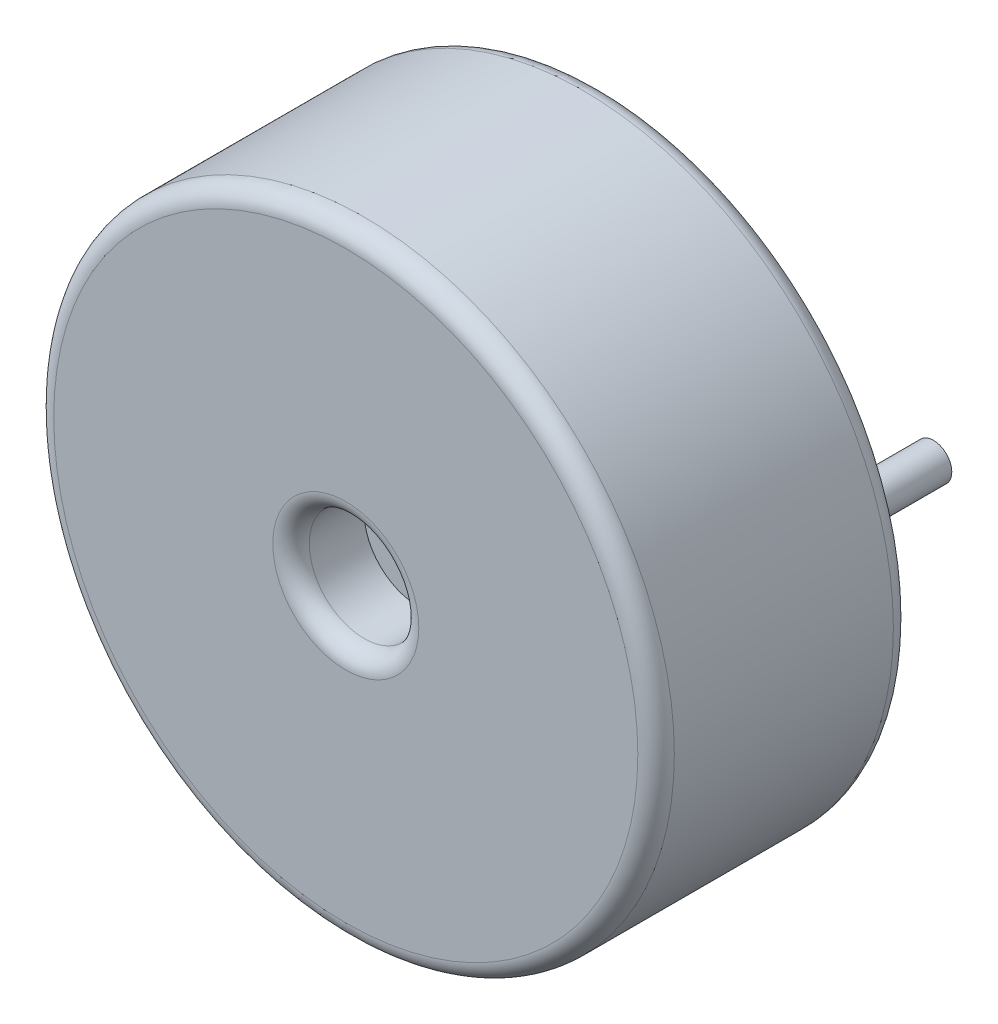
ISO-10303-21;
HEADER;
FILE_DESCRIPTION(('STEP AP214'),'2;1');
FILE_NAME('part.step','',(''),(''),'','','');
FILE_SCHEMA(('AUTOMOTIVE_DESIGN { 1 0 10303 214 1 1 1 1 }'));
ENDSEC;
DATA;
#1=APPLICATION_CONTEXT('core data for automotive mechanical design processes');
#2=APPLICATION_PROTOCOL_DEFINITION('international standard','automotive_design',2000,#1);
#3=PRODUCT_CONTEXT('',#1,'mechanical');
#4=PRODUCT('Part','Part','',(#3));
#5=PRODUCT_RELATED_PRODUCT_CATEGORY('part','',(#4));
#6=PRODUCT_DEFINITION_FORMATION('','',#4);
#7=PRODUCT_DEFINITION_CONTEXT('part definition',#1,'design');
#8=PRODUCT_DEFINITION('design','',#6,#7);
#9=PRODUCT_DEFINITION_SHAPE('','',#8);
#10=(LENGTH_UNIT() NAMED_UNIT(*) SI_UNIT(.MILLI.,.METRE.));
#11=(NAMED_UNIT(*) PLANE_ANGLE_UNIT() SI_UNIT($,.RADIAN.));
#12=(NAMED_UNIT(*) SI_UNIT($,.STERADIAN.) SOLID_ANGLE_UNIT());
#13=UNCERTAINTY_MEASURE_WITH_UNIT(LENGTH_MEASURE(1.E-05),#10,'distance_accuracy_value','');
#14=(GEOMETRIC_REPRESENTATION_CONTEXT(3) GLOBAL_UNCERTAINTY_ASSIGNED_CONTEXT((#13)) GLOBAL_UNIT_ASSIGNED_CONTEXT((#10,
#11,#12)) REPRESENTATION_CONTEXT('',''));
#15=CARTESIAN_POINT('',(0.,0.,0.));
#16=DIRECTION('',(0.,0.,1.));
#17=DIRECTION('',(1.,0.,0.));
#18=AXIS2_PLACEMENT_3D('',#15,#16,#17);
#19=CARTESIAN_POINT('',(0.,0.,0.));
#20=DIRECTION('',(0.,0.,1.));
#21=DIRECTION('',(1.,0.,0.));
#22=AXIS2_PLACEMENT_3D('',#19,#20,#21);
#23=PLANE('',#22);
#24=CARTESIAN_POINT('',(0.,0.,0.));
#25=DIRECTION('',(0.,0.,1.));
#26=DIRECTION('',(1.,0.,0.));
#27=AXIS2_PLACEMENT_3D('',#24,#25,#26);
#28=CIRCLE('',#27,8.);
#29=CARTESIAN_POINT('',(8.,0.,0.));
#30=VERTEX_POINT('',#29);
#31=EDGE_CURVE('E10',#30,#30,#28,.F.);
#32=ORIENTED_EDGE('',*,*,#31,.T.);
#33=EDGE_LOOP('',(#32));
#34=FACE_BOUND('',#33,.T.);
#35=CARTESIAN_POINT('',(5.1,0.,0.));
#36=DIRECTION('',(0.,0.,1.));
#37=DIRECTION('',(1.,0.,0.));
#38=AXIS2_PLACEMENT_3D('',#35,#36,#37);
#39=CIRCLE('',#38,0.5);
#40=CARTESIAN_POINT('',(5.6,0.,0.));
#41=VERTEX_POINT('',#40);
#42=EDGE_CURVE('E44',#41,#41,#39,.F.);
#43=ORIENTED_EDGE('',*,*,#42,.F.);
#44=EDGE_LOOP('',(#43));
#45=FACE_BOUND('',#44,.T.);
#46=CARTESIAN_POINT('',(-5.1,0.,0.));
#47=DIRECTION('',(0.,0.,1.));
#48=DIRECTION('',(1.,0.,0.));
#49=AXIS2_PLACEMENT_3D('',#46,#47,#48);
#50=CIRCLE('',#49,0.500000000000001);
#51=CARTESIAN_POINT('',(-4.6,0.,0.));
#52=VERTEX_POINT('',#51);
#53=EDGE_CURVE('E41',#52,#52,#50,.F.);
#54=ORIENTED_EDGE('',*,*,#53,.F.);
#55=EDGE_LOOP('',(#54));
#56=FACE_BOUND('',#55,.T.);
#57=ADVANCED_FACE('F15',(#34,#45,#56),#23,.F.);
#58=CARTESIAN_POINT('',(0.,0.,7.));
#59=DIRECTION('',(0.,0.,-1.));
#60=DIRECTION('',(-1.,0.,0.));
#61=AXIS2_PLACEMENT_3D('',#58,#59,#60);
#62=CYLINDRICAL_SURFACE('',#61,8.5);
#63=CARTESIAN_POINT('',(0.,0.,0.5));
#64=DIRECTION('',(0.,0.,1.));
#65=DIRECTION('',(1.,0.,0.));
#66=AXIS2_PLACEMENT_3D('',#63,#64,#65);
#67=CIRCLE('',#66,8.5);
#68=CARTESIAN_POINT('',(8.5,0.,0.5));
#69=VERTEX_POINT('',#68);
#70=EDGE_CURVE('E22',#69,#69,#67,.T.);
#71=ORIENTED_EDGE('',*,*,#70,.T.);
#72=EDGE_LOOP('',(#71));
#73=FACE_BOUND('',#72,.T.);
#74=CARTESIAN_POINT('',(0.,0.,6.5));
#75=DIRECTION('',(0.,0.,1.));
#76=DIRECTION('',(1.,0.,0.));
#77=AXIS2_PLACEMENT_3D('',#74,#75,#76);
#78=CIRCLE('',#77,8.5);
#79=CARTESIAN_POINT('',(8.5,0.,6.5));
#80=VERTEX_POINT('',#79);
#81=EDGE_CURVE('E26',#80,#80,#78,.F.);
#82=ORIENTED_EDGE('',*,*,#81,.T.);
#83=EDGE_LOOP('',(#82));
#84=FACE_BOUND('',#83,.T.);
#85=ADVANCED_FACE('F17',(#73,#84),#62,.T.);
#86=CARTESIAN_POINT('',(0.,0.,7.));
#87=DIRECTION('',(0.,0.,1.));
#88=DIRECTION('',(1.,0.,0.));
#89=AXIS2_PLACEMENT_3D('',#86,#87,#88);
#90=PLANE('',#89);
#91=CARTESIAN_POINT('',(0.,0.,7.));
#92=DIRECTION('',(0.,0.,1.));
#93=DIRECTION('',(1.,0.,0.));
#94=AXIS2_PLACEMENT_3D('',#91,#92,#93);
#95=CIRCLE('',#94,2.);
#96=CARTESIAN_POINT('',(2.,0.,7.));
#97=VERTEX_POINT('',#96);
#98=EDGE_CURVE('E30',#97,#97,#95,.F.);
#99=ORIENTED_EDGE('',*,*,#98,.T.);
#100=EDGE_LOOP('',(#99));
#101=FACE_BOUND('',#100,.T.);
#102=CARTESIAN_POINT('',(0.,0.,7.));
#103=DIRECTION('',(0.,0.,1.));
#104=DIRECTION('',(1.,0.,0.));
#105=AXIS2_PLACEMENT_3D('',#102,#103,#104);
#106=CIRCLE('',#105,8.);
#107=CARTESIAN_POINT('',(8.,0.,7.));
#108=VERTEX_POINT('',#107);
#109=EDGE_CURVE('E35',#108,#108,#106,.T.);
#110=ORIENTED_EDGE('',*,*,#109,.T.);
#111=EDGE_LOOP('',(#110));
#112=FACE_BOUND('',#111,.T.);
#113=ADVANCED_FACE('F73',(#101,#112),#90,.T.);
#114=CARTESIAN_POINT('',(0.,0.,5.));
#115=DIRECTION('',(0.,0.,1.));
#116=DIRECTION('',(1.,0.,0.));
#117=AXIS2_PLACEMENT_3D('',#114,#115,#116);
#118=CYLINDRICAL_SURFACE('',#117,1.5);
#119=CARTESIAN_POINT('',(0.,0.,6.5));
#120=DIRECTION('',(0.,0.,1.));
#121=DIRECTION('',(1.,0.,0.));
#122=AXIS2_PLACEMENT_3D('',#119,#120,#121);
#123=CIRCLE('',#122,1.5);
#124=CARTESIAN_POINT('',(1.5,0.,6.5));
#125=VERTEX_POINT('',#124);
#126=EDGE_CURVE('E38',#125,#125,#123,.T.);
#127=ORIENTED_EDGE('',*,*,#126,.T.);
#128=EDGE_LOOP('',(#127));
#129=FACE_BOUND('',#128,.T.);
#130=CARTESIAN_POINT('',(0.,0.,5.));
#131=DIRECTION('',(0.,0.,1.));
#132=DIRECTION('',(1.,0.,0.));
#133=AXIS2_PLACEMENT_3D('',#130,#131,#132);
#134=CIRCLE('',#133,1.5);
#135=CARTESIAN_POINT('',(1.5,0.,5.));
#136=VERTEX_POINT('',#135);
#137=EDGE_CURVE('E47',#136,#136,#134,.T.);
#138=ORIENTED_EDGE('',*,*,#137,.F.);
#139=EDGE_LOOP('',(#138));
#140=FACE_BOUND('',#139,.T.);
#141=ADVANCED_FACE('F76',(#129,#140),#118,.F.);
#142=CARTESIAN_POINT('',(0.,0.,5.));
#143=DIRECTION('',(0.,0.,1.));
#144=DIRECTION('',(1.,0.,0.));
#145=AXIS2_PLACEMENT_3D('',#142,#143,#144);
#146=PLANE('',#145);
#147=ORIENTED_EDGE('',*,*,#137,.T.);
#148=EDGE_LOOP('',(#147));
#149=FACE_BOUND('',#148,.T.);
#150=ADVANCED_FACE('F85',(#149),#146,.T.);
#151=CARTESIAN_POINT('',(5.1,0.,-4.));
#152=DIRECTION('',(0.,0.,1.));
#153=DIRECTION('',(1.,0.,0.));
#154=AXIS2_PLACEMENT_3D('',#151,#152,#153);
#155=CYLINDRICAL_SURFACE('',#154,0.5);
#156=CARTESIAN_POINT('',(5.1,0.,-4.));
#157=DIRECTION('',(0.,0.,-1.));
#158=DIRECTION('',(-1.,0.,0.));
#159=AXIS2_PLACEMENT_3D('',#156,#157,#158);
#160=CIRCLE('',#159,0.5);
#161=CARTESIAN_POINT('',(4.6,0.,-4.));
#162=VERTEX_POINT('',#161);
#163=EDGE_CURVE('E50',#162,#162,#160,.T.);
#164=ORIENTED_EDGE('',*,*,#163,.F.);
#165=EDGE_LOOP('',(#164));
#166=FACE_BOUND('',#165,.T.);
#167=ORIENTED_EDGE('',*,*,#42,.T.);
#168=EDGE_LOOP('',(#167));
#169=FACE_BOUND('',#168,.T.);
#170=ADVANCED_FACE('F112',(#166,#169),#155,.T.);
#171=CARTESIAN_POINT('',(5.1,0.,-4.));
#172=DIRECTION('',(0.,0.,-1.));
#173=DIRECTION('',(-1.,0.,0.));
#174=AXIS2_PLACEMENT_3D('',#171,#172,#173);
#175=PLANE('',#174);
#176=ORIENTED_EDGE('',*,*,#163,.T.);
#177=EDGE_LOOP('',(#176));
#178=FACE_BOUND('',#177,.T.);
#179=ADVANCED_FACE('F62',(#178),#175,.T.);
#180=CARTESIAN_POINT('',(-5.1,0.,-4.));
#181=DIRECTION('',(0.,0.,1.));
#182=DIRECTION('',(1.,0.,0.));
#183=AXIS2_PLACEMENT_3D('',#180,#181,#182);
#184=CYLINDRICAL_SURFACE('',#183,0.500000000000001);
#185=CARTESIAN_POINT('',(-5.1,0.,-4.));
#186=DIRECTION('',(0.,0.,-1.));
#187=DIRECTION('',(-1.,0.,0.));
#188=AXIS2_PLACEMENT_3D('',#185,#186,#187);
#189=CIRCLE('',#188,0.500000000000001);
#190=CARTESIAN_POINT('',(-5.6,0.,-4.));
#191=VERTEX_POINT('',#190);
#192=EDGE_CURVE('E53',#191,#191,#189,.T.);
#193=ORIENTED_EDGE('',*,*,#192,.F.);
#194=EDGE_LOOP('',(#193));
#195=FACE_BOUND('',#194,.T.);
#196=ORIENTED_EDGE('',*,*,#53,.T.);
#197=EDGE_LOOP('',(#196));
#198=FACE_BOUND('',#197,.T.);
#199=ADVANCED_FACE('F59',(#195,#198),#184,.T.);
#200=CARTESIAN_POINT('',(-5.1,0.,-4.));
#201=DIRECTION('',(0.,0.,-1.));
#202=DIRECTION('',(-1.,0.,0.));
#203=AXIS2_PLACEMENT_3D('',#200,#201,#202);
#204=PLANE('',#203);
#205=ORIENTED_EDGE('',*,*,#192,.T.);
#206=EDGE_LOOP('',(#205));
#207=FACE_BOUND('',#206,.T.);
#208=ADVANCED_FACE('F57',(#207),#204,.T.);
#209=CARTESIAN_POINT('',(0.,0.,6.5));
#210=DIRECTION('',(0.,0.,1.));
#211=DIRECTION('',(1.,0.,0.));
#212=AXIS2_PLACEMENT_3D('',#209,#210,#211);
#213=TOROIDAL_SURFACE('',#212,2.,0.5);
#214=ORIENTED_EDGE('',*,*,#98,.F.);
#215=EDGE_LOOP('',(#214));
#216=FACE_BOUND('',#215,.T.);
#217=ORIENTED_EDGE('',*,*,#126,.F.);
#218=EDGE_LOOP('',(#217));
#219=FACE_BOUND('',#218,.T.);
#220=ADVANCED_FACE('F100',(#216,#219),#213,.T.);
#221=CARTESIAN_POINT('',(0.,0.,0.5));
#222=DIRECTION('',(0.,0.,1.));
#223=DIRECTION('',(1.,0.,0.));
#224=AXIS2_PLACEMENT_3D('',#221,#222,#223);
#225=TOROIDAL_SURFACE('',#224,8.,0.5);
#226=ORIENTED_EDGE('',*,*,#31,.F.);
#227=EDGE_LOOP('',(#226));
#228=FACE_BOUND('',#227,.T.);
#229=ORIENTED_EDGE('',*,*,#70,.F.);
#230=EDGE_LOOP('',(#229));
#231=FACE_BOUND('',#230,.T.);
#232=ADVANCED_FACE('F93',(#228,#231),#225,.T.);
#233=CARTESIAN_POINT('',(0.,0.,6.5));
#234=DIRECTION('',(0.,0.,1.));
#235=DIRECTION('',(1.,0.,0.));
#236=AXIS2_PLACEMENT_3D('',#233,#234,#235);
#237=TOROIDAL_SURFACE('',#236,8.,0.5);
#238=ORIENTED_EDGE('',*,*,#81,.F.);
#239=EDGE_LOOP('',(#238));
#240=FACE_BOUND('',#239,.T.);
#241=ORIENTED_EDGE('',*,*,#109,.F.);
#242=EDGE_LOOP('',(#241));
#243=FACE_BOUND('',#242,.T.);
#244=ADVANCED_FACE('F91',(#240,#243),#237,.T.);
#245=CLOSED_SHELL('',(#57,#85,#113,#141,#150,#170,#179,#199,#208,#220,#232,#244));
#246=MANIFOLD_SOLID_BREP('B1',#245);
#247=ADVANCED_BREP_SHAPE_REPRESENTATION('',(#18,#246),#14);
#248=SHAPE_DEFINITION_REPRESENTATION(#9,#247);
ENDSEC;
END-ISO-10303-21;
